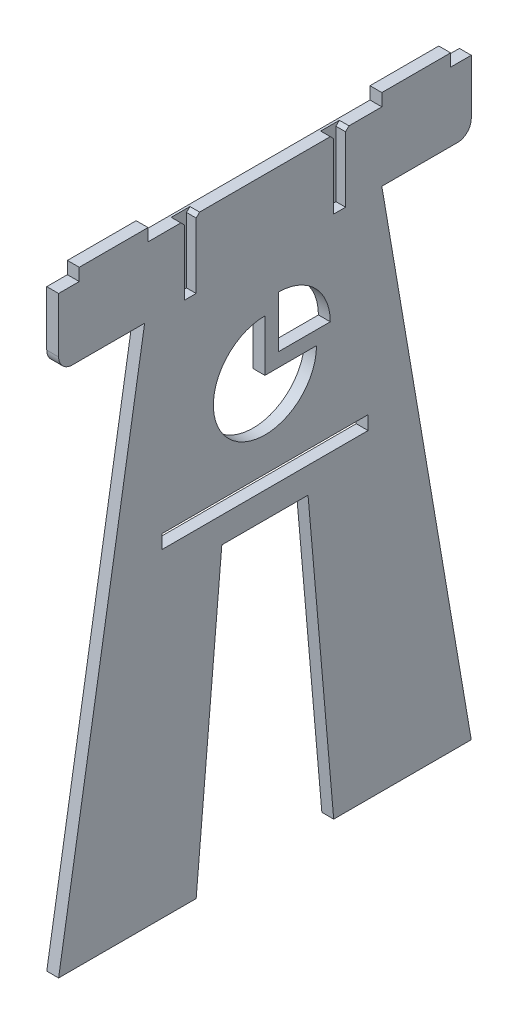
from build123d import *

# Parameters (mm, degrees)
BOSS_EXTRUDE1_DEPTH = 17.25
CUT_EXTRUDE2_START  = 17.25
SKETCH2_W           = 17.25
SKETCH2_H           = 100
CUT_EXTRUDE2_DEPTH  = 14
FILLET1_R           = 20
CHAMFER1_SIZE       = 5
PIZZA_START         = 17.25
PIZZA_CUTOUT_DEPTH  = 1024.906105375
CUT_EXTRUDE4_START  = 17.25
CUT_EXTRUDE4_DEPTH  = 1024.906105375
CUT_EXTRUDE6_START  = 17.25
SKETCH6_W           = 300
SKETCH6_H           = 20
CUT_EXTRUDE6_DEPTH  = 1024.906105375


with BuildPart() as part:
    # Sketch1 → Boss-Extrude1 (new body)
    with BuildSketch(Plane(origin=(0, 0, 0), x_dir=(0, 0, -1), z_dir=(1, 0, 0))):
        Polygon((-80.37037037, 0), (-50.37037037, 0), (-50.37037037, 18), (49.62962963, 18), (49.62962963, 0), (389.62962963, 0), (389.62962963, 18), (489.62962963, 18), (489.62962963, 0), (519.62962963, 0), (519.62962963, -100), (389.62962963, -100), (519.62962963, -862), (319.62962963, -862), (282.297405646, -435.290727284), (156.961853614, -435.290727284), (119.62962963, -862), (-80.37037037, -862), (44.705387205, -100), (-80.37037037, -100), align=None)
    extrude(amount=BOSS_EXTRUDE1_DEPTH)

    # Sketch2 → Cut-Extrude2 (cut)
    with BuildSketch(Plane(origin=(0, 0, 0), x_dir=(0, 0, -1), z_dir=(1, 0, 0)).offset(CUT_EXTRUDE2_START)):
        with Locations((111.00462963, -50)):
            Rectangle(SKETCH2_W, SKETCH2_H)
        with Locations((328.25462963, -50)):
            Rectangle(SKETCH2_W, SKETCH2_H)
    extrude(amount=-CUT_EXTRUDE2_DEPTH, mode=Mode.SUBTRACT)

    # Fillet1
    fillet1_edges = [part.edges().sort_by_distance(p)[0] for p in [
        (8.625, -100, -519.62962963),
        (8.625, -100, 80.37037037),
    ]]
    fillet(fillet1_edges, radius=FILLET1_R)

    # Chamfer1
    chamfer1_edges = [part.edges().sort_by_distance(p)[0] for p in [
        (10.25, 0, -102.37962963),
        (10.25, 0, -119.62962963),
        (10.25, 0, -319.62962963),
        (10.25, 0, -336.87962963),
    ]]
    chamfer(chamfer1_edges, length=CHAMFER1_SIZE)

    # Sketch3 → Pizza Cutout (cut, through all)
    with BuildSketch(Plane(origin=(0, 0, 0), x_dir=(0, 0, -1), z_dir=(1, 0, 0)).offset(PIZZA_START)):
        with BuildLine():
            Line((294.62962963, -253.175250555), (219.62962963, -253.175250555))
            Line((219.62962963, -253.175250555), (219.62962963, -178.175250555))
            ThreePointArc((219.62962963, -178.175250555), (166.596621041, -306.208259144), (294.62962963, -253.175250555))
        make_face()
    extrude(amount=-PIZZA_CUTOUT_DEPTH, mode=Mode.SUBTRACT)

    # Sketch4 → Cut-Extrude4 (cut, through all)
    with BuildSketch(Plane(origin=(0, 0, 0), x_dir=(0, 0, -1), z_dir=(1, 0, 0)).offset(CUT_EXTRUDE4_START)):
        with BuildLine():
            Line((314.62962963, -233.175250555), (239.62962963, -233.175250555))
            Line((239.62962963, -233.175250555), (239.62962963, -158.175250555))
            ThreePointArc((239.62962963, -158.175250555), (292.662638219, -180.142241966), (314.62962963, -233.175250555))
        make_face()
    extrude(amount=-CUT_EXTRUDE4_DEPTH, mode=Mode.SUBTRACT)

    # Sketch6 → Cut-Extrude6 (cut, through all)
    with BuildSketch(Plane(origin=(0, 0, 0), x_dir=(0, 0, -1), z_dir=(1, 0, 0)).offset(CUT_EXTRUDE6_START)):
        with Locations((219.62962963, -387.634531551)):
            Rectangle(SKETCH6_W, SKETCH6_H)
    extrude(amount=-CUT_EXTRUDE6_DEPTH, mode=Mode.SUBTRACT)


solid = part.part
